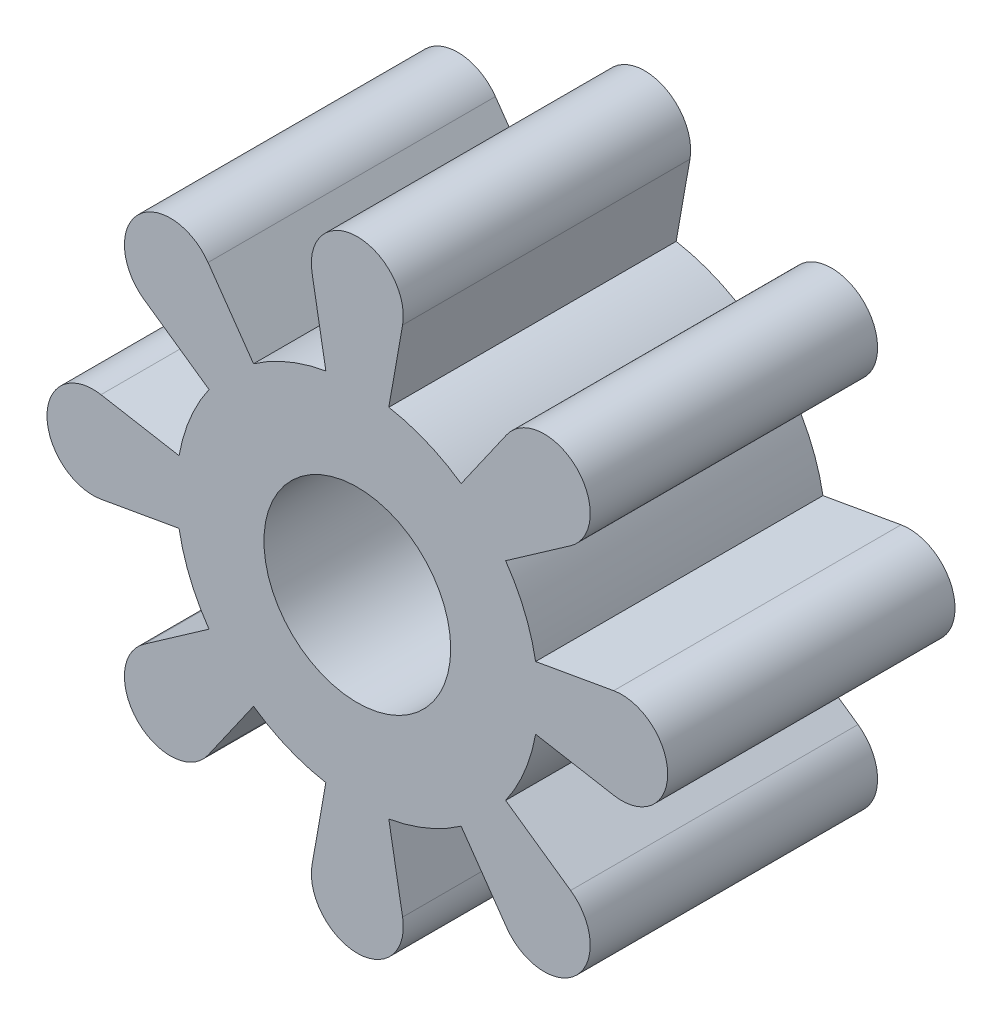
from build123d import *

# Parameters (mm, degrees)
SKETCH_1_R      = 3.25
EXTRUDE_1_DEPTH = 10


with BuildPart() as part:
    # Sketch 1 → Extrude 1 (new body)
    with BuildSketch(Plane.XY):
        with BuildLine():
            Line((-1.095652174, 6.203994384), (-1.575617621, 8.92173913))
            ThreePointArc((-1.575617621, 8.92173913), (0, 10.8), (1.575617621, 8.92173913))
            Line((1.575617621, 8.92173913), (1.095652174, 6.203994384))
            ThreePointArc((1.095652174, 6.203994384), (2.410905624, 5.820441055), (3.612143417, 5.161629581))
            Line((3.612143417, 5.161629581), (5.194492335, 7.422752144))
            ThreePointArc((5.194492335, 7.422752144), (7.636753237, 7.636753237), (7.422752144, 5.194492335))
            Line((7.422752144, 5.194492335), (5.161629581, 3.612143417))
            ThreePointArc((5.161629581, 3.612143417), (5.820441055, 2.410905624), (6.203994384, 1.095652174))
            Line((6.203994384, 1.095652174), (8.92173913, 1.575617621))
            ThreePointArc((8.92173913, 1.575617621), (10.8, 0), (8.92173913, -1.575617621))
            Line((8.92173913, -1.575617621), (6.203994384, -1.095652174))
            ThreePointArc((6.203994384, -1.095652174), (5.820441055, -2.410905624), (5.161629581, -3.612143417))
            Line((5.161629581, -3.612143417), (7.422752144, -5.194492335))
            ThreePointArc((7.422752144, -5.194492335), (7.636753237, -7.636753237), (5.194492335, -7.422752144))
            Line((5.194492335, -7.422752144), (3.612143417, -5.161629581))
            ThreePointArc((3.612143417, -5.161629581), (2.410905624, -5.820441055), (1.095652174, -6.203994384))
            Line((1.095652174, -6.203994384), (1.575617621, -8.92173913))
            ThreePointArc((1.575617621, -8.92173913), (0, -10.8), (-1.575617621, -8.92173913))
            Line((-1.575617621, -8.92173913), (-1.095652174, -6.203994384))
            ThreePointArc((-1.095652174, -6.203994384), (-2.410905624, -5.820441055), (-3.612143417, -5.161629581))
            Line((-3.612143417, -5.161629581), (-5.194492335, -7.422752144))
            ThreePointArc((-5.194492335, -7.422752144), (-7.636753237, -7.636753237), (-7.422752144, -5.194492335))
            Line((-7.422752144, -5.194492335), (-5.161629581, -3.612143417))
            ThreePointArc((-5.161629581, -3.612143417), (-5.820441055, -2.410905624), (-6.203994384, -1.095652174))
            Line((-6.203994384, -1.095652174), (-8.92173913, -1.575617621))
            ThreePointArc((-8.92173913, -1.575617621), (-10.8, 0), (-8.92173913, 1.575617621))
            Line((-8.92173913, 1.575617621), (-6.203994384, 1.095652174))
            ThreePointArc((-6.203994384, 1.095652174), (-5.820441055, 2.410905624), (-5.161629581, 3.612143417))
            Line((-5.161629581, 3.612143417), (-7.422752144, 5.194492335))
            ThreePointArc((-7.422752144, 5.194492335), (-7.636753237, 7.636753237), (-5.194492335, 7.422752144))
            Line((-5.194492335, 7.422752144), (-3.612143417, 5.161629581))
            ThreePointArc((-3.612143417, 5.161629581), (-2.410905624, 5.820441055), (-1.095652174, 6.203994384))
        make_face()
        Circle(SKETCH_1_R, mode=Mode.SUBTRACT)
    extrude(amount=EXTRUDE_1_DEPTH)


solid = part.part
